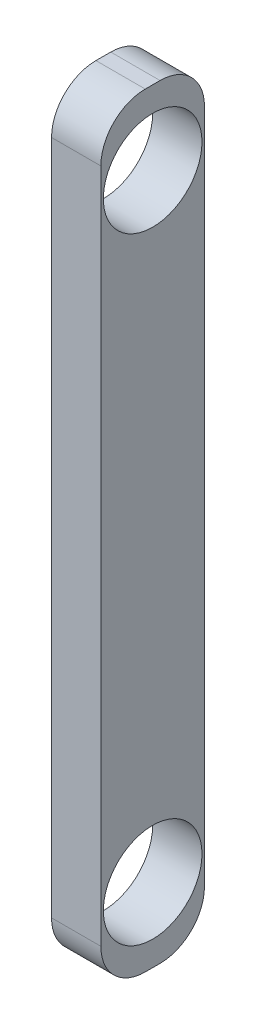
from build123d import *

# Parameters (mm, degrees)
SKETCH1_W           = 4.2
SKETCH1_H           = 31
SKETCH1_R           = 2
BOSS_EXTRUDE1_DEPTH = 2
FILLET1_R           = 1.8


with BuildPart() as part:
    # Sketch1 → Boss-Extrude1 (new body)
    with BuildSketch(Plane(origin=(0, 0, 0), x_dir=(0, 0, -1), z_dir=(1, 0, 0))):
        with Locations((0, 15.5)):
            Rectangle(SKETCH1_W, SKETCH1_H)
        with Locations((0, 28)):
            Circle(SKETCH1_R, mode=Mode.SUBTRACT)
        with Locations((0, 3)):
            Circle(SKETCH1_R, mode=Mode.SUBTRACT)
    extrude(amount=BOSS_EXTRUDE1_DEPTH)

    # Fillet1
    fillet1_edges = [part.edges().sort_by_distance(p)[0] for p in [
        (1, 31, 2.1),
        (1, 31, -2.1),
        (1, 0, -2.1),
        (1, 0, 2.1),
    ]]
    fillet(fillet1_edges, radius=FILLET1_R)


solid = part.part
